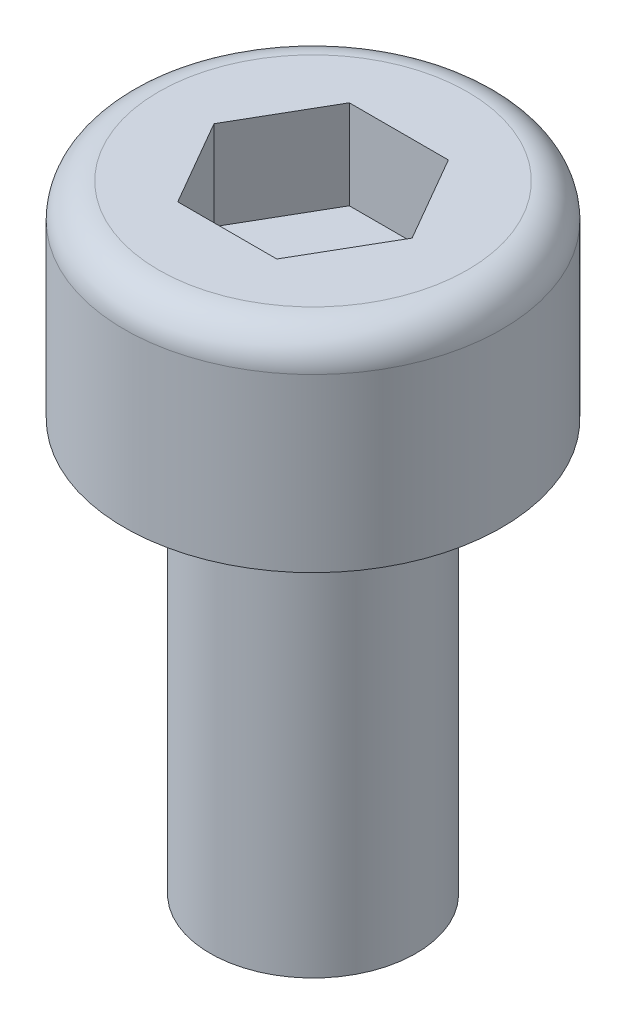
ISO-10303-21;
HEADER;
FILE_DESCRIPTION(('STEP AP214'),'2;1');
FILE_NAME('part.step','',(''),(''),'','','');
FILE_SCHEMA(('AUTOMOTIVE_DESIGN { 1 0 10303 214 1 1 1 1 }'));
ENDSEC;
DATA;
#1=APPLICATION_CONTEXT('core data for automotive mechanical design processes');
#2=APPLICATION_PROTOCOL_DEFINITION('international standard','automotive_design',2000,#1);
#3=PRODUCT_CONTEXT('',#1,'mechanical');
#4=PRODUCT('Part','Part','',(#3));
#5=PRODUCT_RELATED_PRODUCT_CATEGORY('part','',(#4));
#6=PRODUCT_DEFINITION_FORMATION('','',#4);
#7=PRODUCT_DEFINITION_CONTEXT('part definition',#1,'design');
#8=PRODUCT_DEFINITION('design','',#6,#7);
#9=PRODUCT_DEFINITION_SHAPE('','',#8);
#10=(LENGTH_UNIT() NAMED_UNIT(*) SI_UNIT(.MILLI.,.METRE.));
#11=(NAMED_UNIT(*) PLANE_ANGLE_UNIT() SI_UNIT($,.RADIAN.));
#12=(NAMED_UNIT(*) SI_UNIT($,.STERADIAN.) SOLID_ANGLE_UNIT());
#13=UNCERTAINTY_MEASURE_WITH_UNIT(LENGTH_MEASURE(1.E-05),#10,'distance_accuracy_value','');
#14=(GEOMETRIC_REPRESENTATION_CONTEXT(3) GLOBAL_UNCERTAINTY_ASSIGNED_CONTEXT((#13)) GLOBAL_UNIT_ASSIGNED_CONTEXT((#10,
#11,#12)) REPRESENTATION_CONTEXT('',''));
#15=CARTESIAN_POINT('',(0.,0.,0.));
#16=DIRECTION('',(0.,0.,1.));
#17=DIRECTION('',(1.,0.,0.));
#18=AXIS2_PLACEMENT_3D('',#15,#16,#17);
#19=CARTESIAN_POINT('',(0.,0.,0.));
#20=DIRECTION('',(0.,1.,0.));
#21=DIRECTION('',(0.,0.,1.));
#22=AXIS2_PLACEMENT_3D('',#19,#20,#21);
#23=PLANE('',#22);
#24=CARTESIAN_POINT('',(0.,0.,0.));
#25=DIRECTION('',(0.,-1.,0.));
#26=DIRECTION('',(0.,0.,-1.));
#27=AXIS2_PLACEMENT_3D('',#24,#25,#26);
#28=CIRCLE('',#27,1.5);
#29=CARTESIAN_POINT('',(0.,0.,-1.5));
#30=VERTEX_POINT('',#29);
#31=EDGE_CURVE('E11',#30,#30,#28,.T.);
#32=ORIENTED_EDGE('',*,*,#31,.T.);
#33=EDGE_LOOP('',(#32));
#34=FACE_BOUND('',#33,.T.);
#35=ADVANCED_FACE('F36',(#34),#23,.F.);
#36=CARTESIAN_POINT('',(0.,0.,0.));
#37=DIRECTION('',(0.,-1.,0.));
#38=DIRECTION('',(0.,0.,-1.));
#39=AXIS2_PLACEMENT_3D('',#36,#37,#38);
#40=CYLINDRICAL_SURFACE('',#39,1.5);
#41=ORIENTED_EDGE('',*,*,#31,.F.);
#42=EDGE_LOOP('',(#41));
#43=FACE_BOUND('',#42,.T.);
#44=CARTESIAN_POINT('',(0.,6.,0.));
#45=DIRECTION('',(0.,-1.,0.));
#46=DIRECTION('',(0.,0.,-1.));
#47=AXIS2_PLACEMENT_3D('',#44,#45,#46);
#48=CIRCLE('',#47,1.5);
#49=CARTESIAN_POINT('',(0.,6.,-1.5));
#50=VERTEX_POINT('',#49);
#51=EDGE_CURVE('E43',#50,#50,#48,.T.);
#52=ORIENTED_EDGE('',*,*,#51,.T.);
#53=EDGE_LOOP('',(#52));
#54=FACE_BOUND('',#53,.T.);
#55=ADVANCED_FACE('F153',(#43,#54),#40,.T.);
#56=CARTESIAN_POINT('',(-1.5,6.,0.));
#57=DIRECTION('',(0.,1.,0.));
#58=DIRECTION('',(0.,0.,1.));
#59=AXIS2_PLACEMENT_3D('',#56,#57,#58);
#60=PLANE('',#59);
#61=ORIENTED_EDGE('',*,*,#51,.F.);
#62=EDGE_LOOP('',(#61));
#63=FACE_BOUND('',#62,.T.);
#64=CARTESIAN_POINT('',(0.,6.,0.));
#65=DIRECTION('',(0.,-1.,0.));
#66=DIRECTION('',(0.,0.,-1.));
#67=AXIS2_PLACEMENT_3D('',#64,#65,#66);
#68=CIRCLE('',#67,2.75);
#69=CARTESIAN_POINT('',(0.,6.,-2.75));
#70=VERTEX_POINT('',#69);
#71=EDGE_CURVE('E148',#70,#70,#68,.T.);
#72=ORIENTED_EDGE('',*,*,#71,.T.);
#73=EDGE_LOOP('',(#72));
#74=FACE_BOUND('',#73,.T.);
#75=ADVANCED_FACE('F155',(#63,#74),#60,.F.);
#76=CARTESIAN_POINT('',(0.,0.,0.));
#77=DIRECTION('',(0.,-1.,0.));
#78=DIRECTION('',(0.,0.,-1.));
#79=AXIS2_PLACEMENT_3D('',#76,#77,#78);
#80=CYLINDRICAL_SURFACE('',#79,2.75);
#81=ORIENTED_EDGE('',*,*,#71,.F.);
#82=EDGE_LOOP('',(#81));
#83=FACE_BOUND('',#82,.T.);
#84=CARTESIAN_POINT('',(0.,8.5,0.));
#85=DIRECTION('',(0.,-1.,0.));
#86=DIRECTION('',(0.,0.,-1.));
#87=AXIS2_PLACEMENT_3D('',#84,#85,#86);
#88=CIRCLE('',#87,2.75);
#89=CARTESIAN_POINT('',(0.,8.5,-2.75));
#90=VERTEX_POINT('',#89);
#91=EDGE_CURVE('E145',#90,#90,#88,.T.);
#92=ORIENTED_EDGE('',*,*,#91,.T.);
#93=EDGE_LOOP('',(#92));
#94=FACE_BOUND('',#93,.T.);
#95=ADVANCED_FACE('F158',(#83,#94),#80,.T.);
#96=CARTESIAN_POINT('',(0.,8.5,0.));
#97=DIRECTION('',(0.,-1.,0.));
#98=DIRECTION('',(0.,0.,-1.));
#99=AXIS2_PLACEMENT_3D('',#96,#97,#98);
#100=TOROIDAL_SURFACE('',#99,2.25,0.500000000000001);
#101=ORIENTED_EDGE('',*,*,#91,.F.);
#102=EDGE_LOOP('',(#101));
#103=FACE_BOUND('',#102,.T.);
#104=CARTESIAN_POINT('',(0.,9.,0.));
#105=DIRECTION('',(0.,-1.,0.));
#106=DIRECTION('',(0.,0.,-1.));
#107=AXIS2_PLACEMENT_3D('',#104,#105,#106);
#108=CIRCLE('',#107,2.25);
#109=CARTESIAN_POINT('',(0.,9.,-2.25));
#110=VERTEX_POINT('',#109);
#111=EDGE_CURVE('E137',#110,#110,#108,.T.);
#112=ORIENTED_EDGE('',*,*,#111,.T.);
#113=EDGE_LOOP('',(#112));
#114=FACE_BOUND('',#113,.T.);
#115=ADVANCED_FACE('F164',(#103,#114),#100,.T.);
#116=CARTESIAN_POINT('',(-2.25,9.,0.));
#117=DIRECTION('',(0.,-1.,0.));
#118=DIRECTION('',(0.,0.,-1.));
#119=AXIS2_PLACEMENT_3D('',#116,#117,#118);
#120=PLANE('',#119);
#121=DIRECTION('',(-1.,0.,0.));
#122=VECTOR('',#121,1.);
#123=CARTESIAN_POINT('',(0.721687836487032,9.,-1.25));
#124=LINE('',#123,#122);
#125=CARTESIAN_POINT('',(0.721687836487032,9.,-1.25));
#126=VERTEX_POINT('',#125);
#127=CARTESIAN_POINT('',(-0.721687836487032,9.,-1.25));
#128=VERTEX_POINT('',#127);
#129=EDGE_CURVE('E124',#126,#128,#124,.T.);
#130=ORIENTED_EDGE('',*,*,#129,.F.);
#131=DIRECTION('',(-0.5,0.,-0.866025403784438));
#132=VECTOR('',#131,1.);
#133=CARTESIAN_POINT('',(1.44337567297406,9.,0.));
#134=LINE('',#133,#132);
#135=CARTESIAN_POINT('',(1.44337567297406,9.,0.));
#136=VERTEX_POINT('',#135);
#137=EDGE_CURVE('E50',#136,#126,#134,.T.);
#138=ORIENTED_EDGE('',*,*,#137,.F.);
#139=DIRECTION('',(0.5,0.,-0.866025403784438));
#140=VECTOR('',#139,1.);
#141=CARTESIAN_POINT('',(0.721687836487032,9.,1.25));
#142=LINE('',#141,#140);
#143=CARTESIAN_POINT('',(0.721687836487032,9.,1.25));
#144=VERTEX_POINT('',#143);
#145=EDGE_CURVE('E133',#144,#136,#142,.T.);
#146=ORIENTED_EDGE('',*,*,#145,.F.);
#147=DIRECTION('',(1.,0.,0.));
#148=VECTOR('',#147,1.);
#149=CARTESIAN_POINT('',(-0.721687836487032,9.,1.25));
#150=LINE('',#149,#148);
#151=CARTESIAN_POINT('',(-0.721687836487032,9.,1.25));
#152=VERTEX_POINT('',#151);
#153=EDGE_CURVE('E131',#152,#144,#150,.T.);
#154=ORIENTED_EDGE('',*,*,#153,.F.);
#155=DIRECTION('',(0.5,0.,0.866025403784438));
#156=VECTOR('',#155,1.);
#157=CARTESIAN_POINT('',(-1.44337567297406,9.,0.));
#158=LINE('',#157,#156);
#159=CARTESIAN_POINT('',(-1.44337567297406,9.,0.));
#160=VERTEX_POINT('',#159);
#161=EDGE_CURVE('E98',#160,#152,#158,.T.);
#162=ORIENTED_EDGE('',*,*,#161,.F.);
#163=DIRECTION('',(-0.5,0.,0.866025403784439));
#164=VECTOR('',#163,1.);
#165=CARTESIAN_POINT('',(-0.721687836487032,9.,-1.25));
#166=LINE('',#165,#164);
#167=EDGE_CURVE('E127',#128,#160,#166,.T.);
#168=ORIENTED_EDGE('',*,*,#167,.F.);
#169=EDGE_LOOP('',(#130,#138,#146,#154,#162,#168));
#170=FACE_BOUND('',#169,.T.);
#171=ORIENTED_EDGE('',*,*,#111,.F.);
#172=EDGE_LOOP('',(#171));
#173=FACE_BOUND('',#172,.T.);
#174=ADVANCED_FACE('F170',(#170,#173),#120,.F.);
#175=CARTESIAN_POINT('',(1.44337567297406,7.7,0.));
#176=DIRECTION('',(0.866025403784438,0.,-0.5));
#177=DIRECTION('',(-0.5,0.,-0.866025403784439));
#178=AXIS2_PLACEMENT_3D('',#175,#176,#177);
#179=PLANE('',#178);
#180=ORIENTED_EDGE('',*,*,#137,.T.);
#181=DIRECTION('',(0.,1.,0.));
#182=VECTOR('',#181,1.);
#183=CARTESIAN_POINT('',(0.721687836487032,7.7,-1.25));
#184=LINE('',#183,#182);
#185=CARTESIAN_POINT('',(0.721687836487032,7.7,-1.25));
#186=VERTEX_POINT('',#185);
#187=EDGE_CURVE('E80',#186,#126,#184,.T.);
#188=ORIENTED_EDGE('',*,*,#187,.F.);
#189=DIRECTION('',(-0.5,0.,-0.866025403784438));
#190=VECTOR('',#189,1.);
#191=CARTESIAN_POINT('',(1.44337567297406,7.7,0.));
#192=LINE('',#191,#190);
#193=CARTESIAN_POINT('',(1.44337567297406,7.7,0.));
#194=VERTEX_POINT('',#193);
#195=EDGE_CURVE('E135',#194,#186,#192,.T.);
#196=ORIENTED_EDGE('',*,*,#195,.F.);
#197=DIRECTION('',(0.,1.,0.));
#198=VECTOR('',#197,1.);
#199=CARTESIAN_POINT('',(1.44337567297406,7.7,0.));
#200=LINE('',#199,#198);
#201=EDGE_CURVE('E58',#194,#136,#200,.T.);
#202=ORIENTED_EDGE('',*,*,#201,.T.);
#203=EDGE_LOOP('',(#180,#188,#196,#202));
#204=FACE_BOUND('',#203,.T.);
#205=ADVANCED_FACE('F175',(#204),#179,.F.);
#206=CARTESIAN_POINT('',(0.721687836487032,7.7,1.25));
#207=DIRECTION('',(0.866025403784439,0.,0.5));
#208=DIRECTION('',(0.5,0.,-0.866025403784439));
#209=AXIS2_PLACEMENT_3D('',#206,#207,#208);
#210=PLANE('',#209);
#211=ORIENTED_EDGE('',*,*,#145,.T.);
#212=ORIENTED_EDGE('',*,*,#201,.F.);
#213=DIRECTION('',(0.5,0.,-0.866025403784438));
#214=VECTOR('',#213,1.);
#215=CARTESIAN_POINT('',(0.721687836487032,7.7,1.25));
#216=LINE('',#215,#214);
#217=CARTESIAN_POINT('',(0.721687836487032,7.7,1.25));
#218=VERTEX_POINT('',#217);
#219=EDGE_CURVE('E110',#218,#194,#216,.T.);
#220=ORIENTED_EDGE('',*,*,#219,.F.);
#221=DIRECTION('',(0.,1.,0.));
#222=VECTOR('',#221,1.);
#223=CARTESIAN_POINT('',(0.721687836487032,7.7,1.25));
#224=LINE('',#223,#222);
#225=EDGE_CURVE('E102',#218,#144,#224,.T.);
#226=ORIENTED_EDGE('',*,*,#225,.T.);
#227=EDGE_LOOP('',(#211,#212,#220,#226));
#228=FACE_BOUND('',#227,.T.);
#229=ADVANCED_FACE('F181',(#228),#210,.F.);
#230=CARTESIAN_POINT('',(-0.721687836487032,7.7,1.25));
#231=DIRECTION('',(0.,0.,1.));
#232=DIRECTION('',(1.,0.,0.));
#233=AXIS2_PLACEMENT_3D('',#230,#231,#232);
#234=PLANE('',#233);
#235=ORIENTED_EDGE('',*,*,#153,.T.);
#236=ORIENTED_EDGE('',*,*,#225,.F.);
#237=DIRECTION('',(1.,0.,0.));
#238=VECTOR('',#237,1.);
#239=CARTESIAN_POINT('',(-0.721687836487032,7.7,1.25));
#240=LINE('',#239,#238);
#241=CARTESIAN_POINT('',(-0.721687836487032,7.7,1.25));
#242=VERTEX_POINT('',#241);
#243=EDGE_CURVE('E106',#242,#218,#240,.T.);
#244=ORIENTED_EDGE('',*,*,#243,.F.);
#245=DIRECTION('',(0.,1.,0.));
#246=VECTOR('',#245,1.);
#247=CARTESIAN_POINT('',(-0.721687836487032,7.7,1.25));
#248=LINE('',#247,#246);
#249=EDGE_CURVE('E91',#242,#152,#248,.T.);
#250=ORIENTED_EDGE('',*,*,#249,.T.);
#251=EDGE_LOOP('',(#235,#236,#244,#250));
#252=FACE_BOUND('',#251,.T.);
#253=ADVANCED_FACE('F107',(#252),#234,.F.);
#254=CARTESIAN_POINT('',(-1.44337567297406,7.7,0.));
#255=DIRECTION('',(-0.866025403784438,0.,0.5));
#256=DIRECTION('',(0.5,0.,0.866025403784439));
#257=AXIS2_PLACEMENT_3D('',#254,#255,#256);
#258=PLANE('',#257);
#259=ORIENTED_EDGE('',*,*,#161,.T.);
#260=ORIENTED_EDGE('',*,*,#249,.F.);
#261=DIRECTION('',(0.5,0.,0.866025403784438));
#262=VECTOR('',#261,1.);
#263=CARTESIAN_POINT('',(-1.44337567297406,7.7,0.));
#264=LINE('',#263,#262);
#265=CARTESIAN_POINT('',(-1.44337567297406,7.7,0.));
#266=VERTEX_POINT('',#265);
#267=EDGE_CURVE('E95',#266,#242,#264,.T.);
#268=ORIENTED_EDGE('',*,*,#267,.F.);
#269=DIRECTION('',(0.,1.,0.));
#270=VECTOR('',#269,1.);
#271=CARTESIAN_POINT('',(-1.44337567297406,7.7,0.));
#272=LINE('',#271,#270);
#273=EDGE_CURVE('E103',#266,#160,#272,.T.);
#274=ORIENTED_EDGE('',*,*,#273,.T.);
#275=EDGE_LOOP('',(#259,#260,#268,#274));
#276=FACE_BOUND('',#275,.T.);
#277=ADVANCED_FACE('F93',(#276),#258,.F.);
#278=CARTESIAN_POINT('',(-0.721687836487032,7.7,-1.25));
#279=DIRECTION('',(-0.866025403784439,0.,-0.5));
#280=DIRECTION('',(-0.5,0.,0.866025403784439));
#281=AXIS2_PLACEMENT_3D('',#278,#279,#280);
#282=PLANE('',#281);
#283=ORIENTED_EDGE('',*,*,#167,.T.);
#284=ORIENTED_EDGE('',*,*,#273,.F.);
#285=DIRECTION('',(-0.5,0.,0.866025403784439));
#286=VECTOR('',#285,1.);
#287=CARTESIAN_POINT('',(-0.721687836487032,7.7,-1.25));
#288=LINE('',#287,#286);
#289=CARTESIAN_POINT('',(-0.721687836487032,7.7,-1.25));
#290=VERTEX_POINT('',#289);
#291=EDGE_CURVE('E116',#290,#266,#288,.T.);
#292=ORIENTED_EDGE('',*,*,#291,.F.);
#293=DIRECTION('',(0.,1.,0.));
#294=VECTOR('',#293,1.);
#295=CARTESIAN_POINT('',(-0.721687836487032,7.7,-1.25));
#296=LINE('',#295,#294);
#297=EDGE_CURVE('E140',#290,#128,#296,.T.);
#298=ORIENTED_EDGE('',*,*,#297,.T.);
#299=EDGE_LOOP('',(#283,#284,#292,#298));
#300=FACE_BOUND('',#299,.T.);
#301=ADVANCED_FACE('F240',(#300),#282,.F.);
#302=CARTESIAN_POINT('',(0.721687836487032,7.7,-1.25));
#303=DIRECTION('',(0.,0.,-1.));
#304=DIRECTION('',(-1.,0.,0.));
#305=AXIS2_PLACEMENT_3D('',#302,#303,#304);
#306=PLANE('',#305);
#307=ORIENTED_EDGE('',*,*,#129,.T.);
#308=ORIENTED_EDGE('',*,*,#297,.F.);
#309=DIRECTION('',(-1.,0.,0.));
#310=VECTOR('',#309,1.);
#311=CARTESIAN_POINT('',(0.721687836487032,7.7,-1.25));
#312=LINE('',#311,#310);
#313=EDGE_CURVE('E118',#186,#290,#312,.T.);
#314=ORIENTED_EDGE('',*,*,#313,.F.);
#315=ORIENTED_EDGE('',*,*,#187,.T.);
#316=EDGE_LOOP('',(#307,#308,#314,#315));
#317=FACE_BOUND('',#316,.T.);
#318=ADVANCED_FACE('F249',(#317),#306,.F.);
#319=CARTESIAN_POINT('',(0.,7.7,0.));
#320=DIRECTION('',(0.,1.,0.));
#321=DIRECTION('',(0.,0.,1.));
#322=AXIS2_PLACEMENT_3D('',#319,#320,#321);
#323=PLANE('',#322);
#324=ORIENTED_EDGE('',*,*,#195,.T.);
#325=ORIENTED_EDGE('',*,*,#313,.T.);
#326=ORIENTED_EDGE('',*,*,#291,.T.);
#327=ORIENTED_EDGE('',*,*,#267,.T.);
#328=ORIENTED_EDGE('',*,*,#243,.T.);
#329=ORIENTED_EDGE('',*,*,#219,.T.);
#330=EDGE_LOOP('',(#324,#325,#326,#327,#328,#329));
#331=FACE_BOUND('',#330,.T.);
#332=ADVANCED_FACE('F113',(#331),#323,.T.);
#333=CLOSED_SHELL('',(#35,#55,#75,#95,#115,#174,#205,#229,#253,#277,#301,#318,#332));
#334=MANIFOLD_SOLID_BREP('B2',#333);
#335=ADVANCED_BREP_SHAPE_REPRESENTATION('',(#18,#334),#14);
#336=SHAPE_DEFINITION_REPRESENTATION(#9,#335);
ENDSEC;
END-ISO-10303-21;
